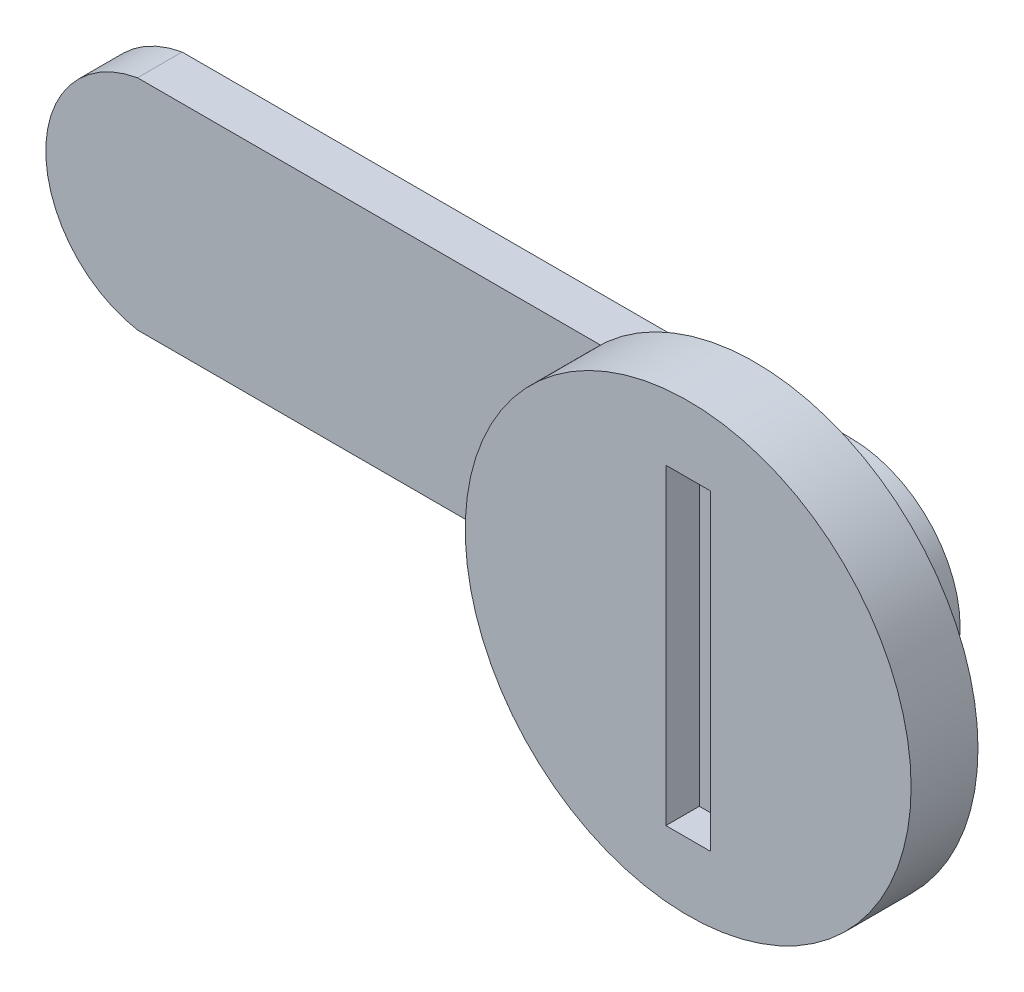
from build123d import *

# Parameters (mm, degrees)
SKETCH1_R           = 10
BOSS_EXTRUDE1_DEPTH = 3
CUT_EXTRUDE1_DEPTH  = 1.5
SKETCH3_R           = 4.9
BOSS_EXTRUDE2_DEPTH = 2.3
BOSS_EXTRUDE3_DEPTH = 2


with BuildPart() as part:
    # Sketch1 → Boss-Extrude1 (new body)
    with BuildSketch(Plane.XY):
        Circle(SKETCH1_R)
    extrude(amount=BOSS_EXTRUDE1_DEPTH)

    # Sketch2 → Cut-Extrude1 (cut)
    with BuildSketch(Plane.XY.offset(3)):
        Polygon((-1, 7), (-1, 0), (-1, -7), (1, -7), (1, 0), (1, 7), align=None)
    extrude(amount=-CUT_EXTRUDE1_DEPTH, mode=Mode.SUBTRACT)

    # Sketch3 → Boss-Extrude2 (add)
    with BuildSketch(Plane(origin=(0, 0, 0), x_dir=(-1, 0, 0), z_dir=(0, 0, -1))):
        Circle(SKETCH3_R)
    extrude(amount=BOSS_EXTRUDE2_DEPTH)

    # Sketch5 → Boss-Extrude3 (add)
    with BuildSketch(Plane(origin=(0, 0, -2.3), x_dir=(-1, 0, 0), z_dir=(0, 0, -1))):
        with BuildLine():
            Line((0, -4.9), (30, -4.9))
            ThreePointArc((30, -4.9), (34.114187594, 0), (30, 4.9))
            Line((30, 4.9), (0, 4.9))
            ThreePointArc((0, 4.9), (-4.9, 0), (0, -4.9))
        make_face()
    extrude(amount=BOSS_EXTRUDE3_DEPTH)


solid = part.part
